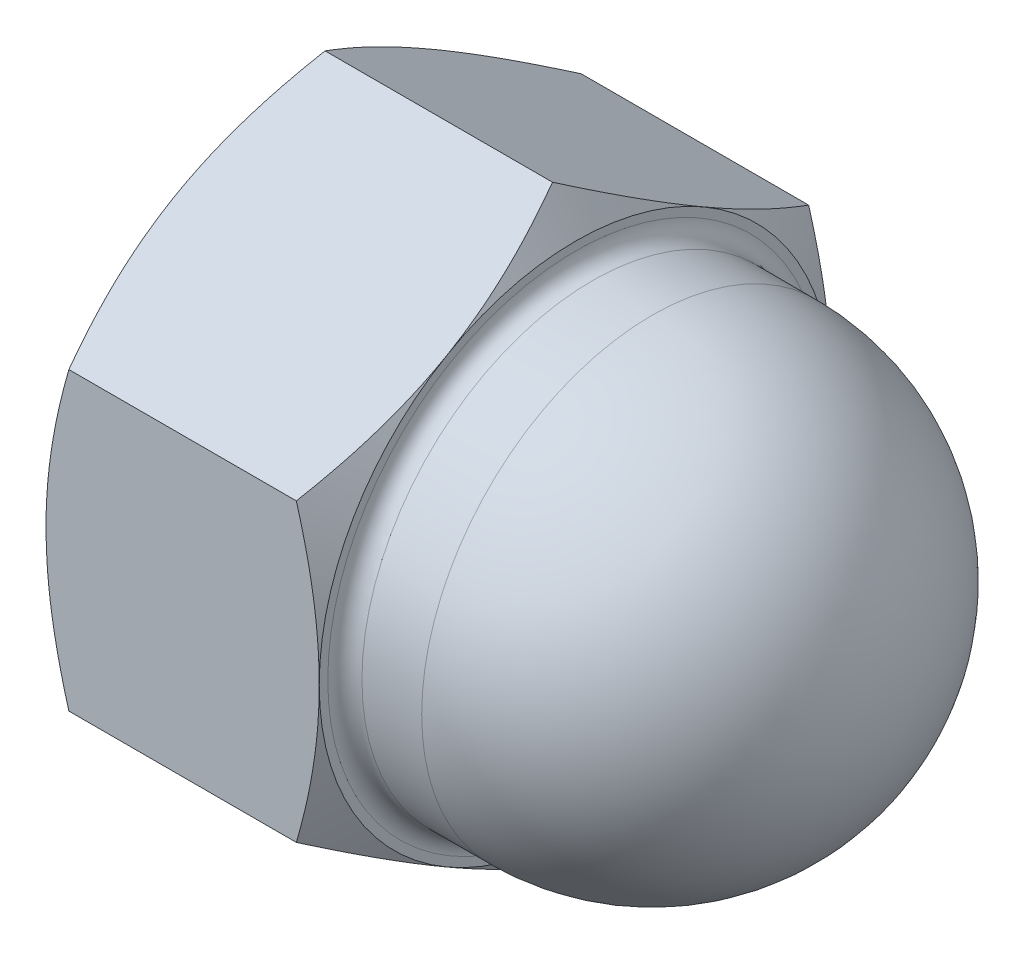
from build123d import *

# Parameters (mm, degrees)
BASENUT_DEPTH = 16
GRVSKE_W      = 6
GRVSKE_H      = 2.75
DOMEFILLET_R  = 1


with BuildPart() as part:
    # BaseNutSke → BaseNut (new body)
    with BuildSketch(Plane(origin=(0, 0, 0), x_dir=(0, 0, -1), z_dir=(1, 0, 0))):
        Polygon((15, 8.660254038), (15, -8.660254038), (0, -17.320508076), (-15, -8.660254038), (-15, 8.660254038), (0, 17.320508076), align=None)
    extrude(amount=BASENUT_DEPTH)

    # DomeSke → Dome (revolve)
    with BuildSketch(Plane.XY, mode=Mode.PRIVATE) as dome_sk:
        with BuildLine():
            Line((34, 0), (0, 0))
            Line((0, 0), (0, 13.5))
            Line((0, 13.5), (20.5, 13.5))
            ThreePointArc((20.5, 13.5), (30.045941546, 9.545941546), (34, 0))
        make_face()
    revolve(dome_sk.sketch.rotate(Axis((0, 0, 0), (1, 0, 0)), 90), axis=Axis((0, 0, 0), (1, 0, 0)))

    # Sketch4 → DoubleChamfer (revolve, cut)
    with BuildSketch(Plane.XY):
        Polygon((0, 15), (2.783121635, 19.820508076), (13.216878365, 19.820508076), (16, 15), (18, 15), (18, 30), (-2, 30), (-2, 15), align=None)
    revolve(axis=Axis((0, 0, 0), (1, 0, 0)), mode=Mode.SUBTRACT)

    # TapDriSke → TapDrill (revolve, cut)
    with BuildSketch(Plane.XY, mode=Mode.PRIVATE) as tapdrill_sk:
        Polygon((0, 8.75), (27, 8.75), (32.257530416, 0), (0, 0), align=None)
    revolve(tapdrill_sk.sketch.rotate(Axis((0, 0, 0), (1, 0, 0)), 90), axis=Axis((0, 0, 0), (1, 0, 0)), mode=Mode.SUBTRACT)

    # GrvSke → Groove (revolve, cut)
    with BuildSketch(Plane.XY, mode=Mode.PRIVATE) as groove_sk:
        with Locations((19, 9.125)):
            Rectangle(GRVSKE_W, GRVSKE_H)
    revolve(groove_sk.sketch.rotate(Axis((0, 0, 0), (1, 0, 0)), 90), axis=Axis((0, 0, 0), (1, 0, 0)), mode=Mode.SUBTRACT)

    # EndChamferSketch → EndChamfer (revolve, cut)
    with BuildSketch(Plane.XY):
        Polygon((-0.0254, 10), (0.0254, 10), (0.988185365, 8.625), (-0.0254, 8.625), align=None)
    revolve(axis=Axis((0, 0, 0), (-1, 0, 0)), mode=Mode.SUBTRACT)

    # DomeFillet
    domefillet_edges = [part.edges().sort_by_distance(p)[0] for p in [
        (16, 0, -13.5),
    ]]
    fillet(domefillet_edges, radius=DOMEFILLET_R)


solid = part.part
